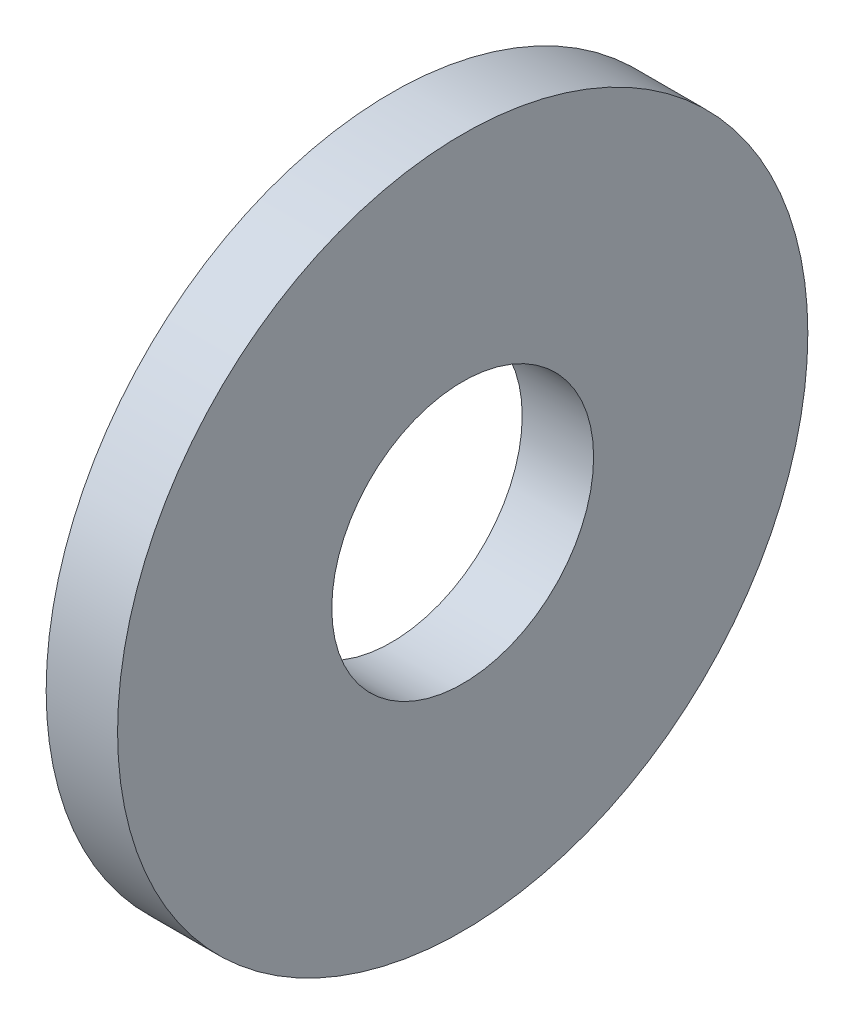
ISO-10303-21;
HEADER;
FILE_DESCRIPTION(('STEP AP214'),'2;1');
FILE_NAME('part.step','',(''),(''),'','','');
FILE_SCHEMA(('AUTOMOTIVE_DESIGN { 1 0 10303 214 1 1 1 1 }'));
ENDSEC;
DATA;
#1=APPLICATION_CONTEXT('core data for automotive mechanical design processes');
#2=APPLICATION_PROTOCOL_DEFINITION('international standard','automotive_design',2000,#1);
#3=PRODUCT_CONTEXT('',#1,'mechanical');
#4=PRODUCT('Part','Part','',(#3));
#5=PRODUCT_RELATED_PRODUCT_CATEGORY('part','',(#4));
#6=PRODUCT_DEFINITION_FORMATION('','',#4);
#7=PRODUCT_DEFINITION_CONTEXT('part definition',#1,'design');
#8=PRODUCT_DEFINITION('design','',#6,#7);
#9=PRODUCT_DEFINITION_SHAPE('','',#8);
#10=(LENGTH_UNIT() NAMED_UNIT(*) SI_UNIT(.MILLI.,.METRE.));
#11=(NAMED_UNIT(*) PLANE_ANGLE_UNIT() SI_UNIT($,.RADIAN.));
#12=(NAMED_UNIT(*) SI_UNIT($,.STERADIAN.) SOLID_ANGLE_UNIT());
#13=UNCERTAINTY_MEASURE_WITH_UNIT(LENGTH_MEASURE(1.E-05),#10,'distance_accuracy_value','');
#14=(GEOMETRIC_REPRESENTATION_CONTEXT(3) GLOBAL_UNCERTAINTY_ASSIGNED_CONTEXT((#13)) GLOBAL_UNIT_ASSIGNED_CONTEXT((#10,
#11,#12)) REPRESENTATION_CONTEXT('',''));
#15=CARTESIAN_POINT('',(0.,0.,0.));
#16=DIRECTION('',(0.,0.,1.));
#17=DIRECTION('',(1.,0.,0.));
#18=AXIS2_PLACEMENT_3D('',#15,#16,#17);
#19=CARTESIAN_POINT('',(3.,0.,0.));
#20=DIRECTION('',(1.,0.,0.));
#21=DIRECTION('',(0.,0.,-1.));
#22=AXIS2_PLACEMENT_3D('',#19,#20,#21);
#23=PLANE('',#22);
#24=CARTESIAN_POINT('',(3.,0.,0.));
#25=DIRECTION('',(1.,0.,0.));
#26=DIRECTION('',(0.,0.,-1.));
#27=AXIS2_PLACEMENT_3D('',#24,#25,#26);
#28=CIRCLE('',#27,14.5);
#29=CARTESIAN_POINT('',(3.,0.,-14.5));
#30=VERTEX_POINT('',#29);
#31=EDGE_CURVE('E10',#30,#30,#28,.T.);
#32=ORIENTED_EDGE('',*,*,#31,.T.);
#33=EDGE_LOOP('',(#32));
#34=FACE_BOUND('',#33,.T.);
#35=CARTESIAN_POINT('',(3.,0.,0.));
#36=DIRECTION('',(1.,0.,0.));
#37=DIRECTION('',(0.,0.,-1.));
#38=AXIS2_PLACEMENT_3D('',#35,#36,#37);
#39=CIRCLE('',#38,5.5);
#40=CARTESIAN_POINT('',(3.,0.,-5.5));
#41=VERTEX_POINT('',#40);
#42=EDGE_CURVE('E41',#41,#41,#39,.T.);
#43=ORIENTED_EDGE('',*,*,#42,.F.);
#44=EDGE_LOOP('',(#43));
#45=FACE_BOUND('',#44,.T.);
#46=ADVANCED_FACE('F30',(#34,#45),#23,.T.);
#47=CARTESIAN_POINT('',(0.,0.,0.));
#48=DIRECTION('',(1.,0.,0.));
#49=DIRECTION('',(0.,0.,-1.));
#50=AXIS2_PLACEMENT_3D('',#47,#48,#49);
#51=PLANE('',#50);
#52=CARTESIAN_POINT('',(0.,0.,0.));
#53=DIRECTION('',(1.,0.,0.));
#54=DIRECTION('',(0.,0.,-1.));
#55=AXIS2_PLACEMENT_3D('',#52,#53,#54);
#56=CIRCLE('',#55,14.5);
#57=CARTESIAN_POINT('',(0.,0.,-14.5));
#58=VERTEX_POINT('',#57);
#59=EDGE_CURVE('E34',#58,#58,#56,.T.);
#60=ORIENTED_EDGE('',*,*,#59,.F.);
#61=EDGE_LOOP('',(#60));
#62=FACE_BOUND('',#61,.T.);
#63=CARTESIAN_POINT('',(0.,0.,0.));
#64=DIRECTION('',(1.,0.,0.));
#65=DIRECTION('',(0.,0.,-1.));
#66=AXIS2_PLACEMENT_3D('',#63,#64,#65);
#67=CIRCLE('',#66,5.5);
#68=CARTESIAN_POINT('',(0.,0.,-5.5));
#69=VERTEX_POINT('',#68);
#70=EDGE_CURVE('E43',#69,#69,#67,.T.);
#71=ORIENTED_EDGE('',*,*,#70,.T.);
#72=EDGE_LOOP('',(#71));
#73=FACE_BOUND('',#72,.T.);
#74=ADVANCED_FACE('F53',(#62,#73),#51,.F.);
#75=CARTESIAN_POINT('',(3.,0.,0.));
#76=DIRECTION('',(-1.,0.,0.));
#77=DIRECTION('',(0.,0.,1.));
#78=AXIS2_PLACEMENT_3D('',#75,#76,#77);
#79=CYLINDRICAL_SURFACE('',#78,14.5);
#80=ORIENTED_EDGE('',*,*,#31,.F.);
#81=EDGE_LOOP('',(#80));
#82=FACE_BOUND('',#81,.T.);
#83=ORIENTED_EDGE('',*,*,#59,.T.);
#84=EDGE_LOOP('',(#83));
#85=FACE_BOUND('',#84,.T.);
#86=ADVANCED_FACE('F32',(#82,#85),#79,.T.);
#87=CARTESIAN_POINT('',(3.,0.,0.));
#88=DIRECTION('',(-1.,0.,0.));
#89=DIRECTION('',(0.,0.,1.));
#90=AXIS2_PLACEMENT_3D('',#87,#88,#89);
#91=CYLINDRICAL_SURFACE('',#90,5.5);
#92=ORIENTED_EDGE('',*,*,#42,.T.);
#93=EDGE_LOOP('',(#92));
#94=FACE_BOUND('',#93,.T.);
#95=ORIENTED_EDGE('',*,*,#70,.F.);
#96=EDGE_LOOP('',(#95));
#97=FACE_BOUND('',#96,.T.);
#98=ADVANCED_FACE('F49',(#94,#97),#91,.F.);
#99=CLOSED_SHELL('',(#46,#74,#86,#98));
#100=MANIFOLD_SOLID_BREP('B2',#99);
#101=ADVANCED_BREP_SHAPE_REPRESENTATION('',(#18,#100),#14);
#102=SHAPE_DEFINITION_REPRESENTATION(#9,#101);
ENDSEC;
END-ISO-10303-21;
